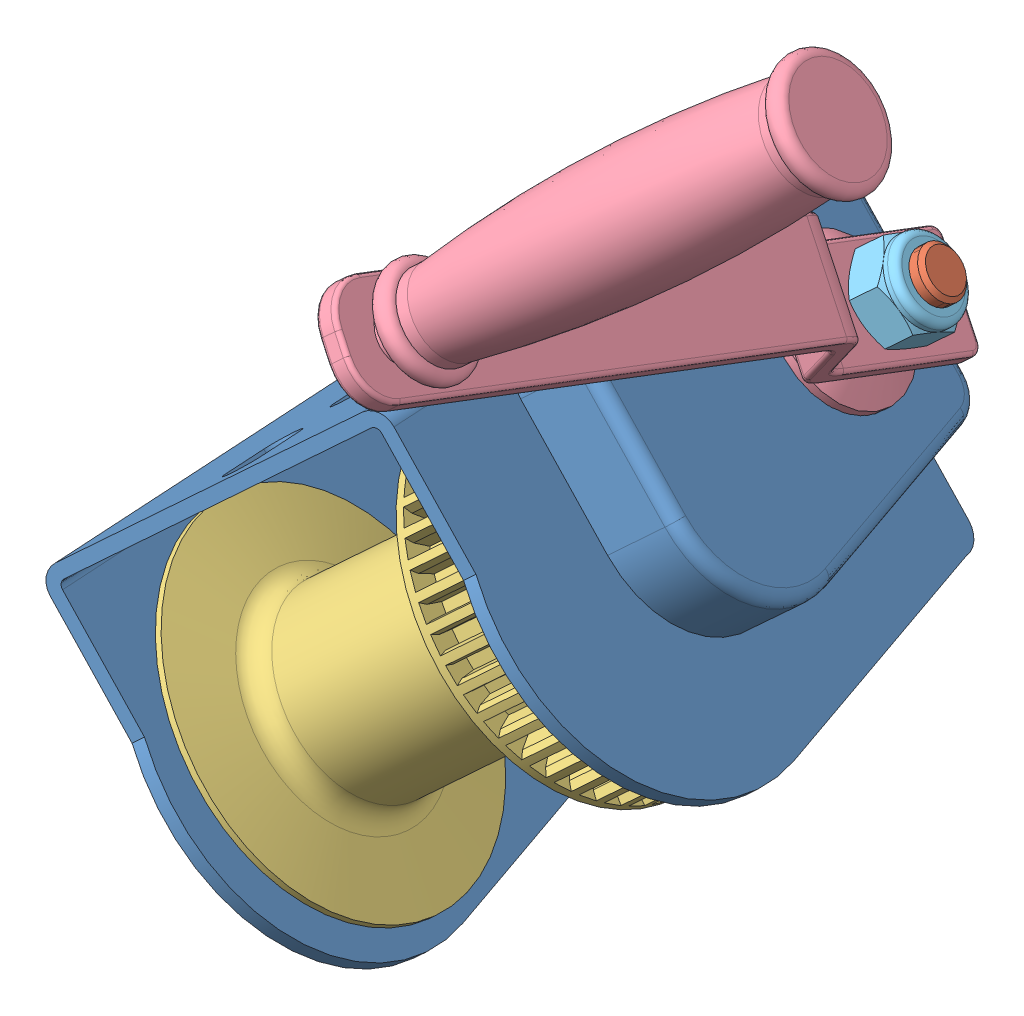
SolidWorks assembly TREUIL 4AF ASM.sldasm, configuration Défaut (file format 7000). Lengths in mm.
Overall size (224.6 291.55 223.87).
5 component instances, 5 part files, 9 mates.
Components (placement in the parent):
- BATI TREUIL 4AF-1: BATI TREUIL 4AF.SLDPRT [Défaut] at (91.5984 -188.4547 71.5388) x (0.720936 0.649082 -0.242783) z (-0.194803 -0.146398 -0.969855) size (108 94.91 127.55)
- AXE MANIVELLE TREUIL 4AF-1: AXE MANIVELLE TREUIL 4AF.SLDPRT [Défaut] at (31.1182 -153.7945 -28.7776) x (-0.531935 0.742855 0.406462) z (0.720936 0.649082 -0.242783) size (35.63 35.18 143)
- BOBINE TREUIL 4AF-1: BOBINE TREUIL 4AF.SLDPRT [Défaut] at (81.4205 -132.9408 13.6493) x (-0.720936 -0.649082 0.242783) z (0.021206 0.32951 0.943914) size (80.5 84 84)
- MANIVELLE TREUIL 4AF-1: MANIVELLE TREUIL 4AF.SLDPRT [Défaut] at (131.994 -2.2992 96.0574) x (0.692992 -0.673465 0.257305) z (0.720936 0.649082 -0.242783) size (35 190 153)
- ECROU NYLSTOP M12-1: ECROU NYLSTOP M12.SLDPRT [Défaut] at (122.4969 -71.5235 -59.5504) x (-0.615996 0.760716 0.204597) z (0.720936 0.649082 -0.242783) size (21.94 19 12)
Mates (geometry in assembly coordinates):
- Coïncidente1: coincident anti-aligned: plane of BATI TREUIL 4AF-1 through (109.8498 -92.3269 -53.8699) normal (0.720936 0.649082 -0.242783); plane of MANIVELLE TREUIL 4AF-1 through (103.2113 -79.1208 -38.276) normal (-0.720936 -0.649082 0.242783)
- Coaxiale2: concentric aligned: cylinder of BATI TREUIL 4AF-1 through (28.7751 -155.9041 -27.9886) axis (-0.720936 -0.649082 0.242783) radius 7; cylinder of AXE MANIVELLE TREUIL 4AF-1 through (31.1191 -153.7937 -28.7779) axis (-0.720936 -0.649082 0.242783) radius 6
- Coïncidente2: coincident anti-aligned: plane of BATI TREUIL 4AF-1 through (54.7338 -159.6471 25.7012) normal (0.720936 0.649082 -0.242783); plane of AXE MANIVELLE TREUIL 4AF-1 through (31.1182 -153.7945 -28.7776) normal (-0.720936 -0.649082 0.242783)
- Coaxiale3: concentric aligned: cylinder of ECROU NYLSTOP M12-1 through (116.0084 -77.3652 -57.3654) axis (-0.720936 -0.649082 0.242783) radius 5.3234; cylinder of AXE MANIVELLE TREUIL 4AF-1 through (31.1191 -153.7937 -28.7779) axis (-0.720936 -0.649082 0.242783) radius 6
- Coïncidente3: coincident anti-aligned: plane of MANIVELLE TREUIL 4AF-1 through (92.909 -61.2321 -82.8263) normal (0.720936 0.649082 -0.242783); plane of ECROU NYLSTOP M12-1 through (116.0084 -77.3652 -57.3654) normal (-0.720936 -0.649082 0.242783)
- Coïncidente4: coincident anti-aligned: plane of BATI TREUIL 4AF-1 through (54.7338 -159.6471 25.7012) normal (0.720936 0.649082 -0.242783); plane of BOBINE TREUIL 4AF-1 through (52.9435 -158.5796 23.2393) normal (-0.720936 -0.649082 0.242783)
- Coaxiale4: concentric aligned: cylinder of BATI TREUIL 4AF-1 through (52.9435 -158.5796 23.2393) axis (-0.720936 -0.649082 0.242783) radius 6; cylinder of BOBINE TREUIL 4AF-1 through (52.9435 -158.5796 23.2393) axis (-0.720936 -0.649082 0.242783) radius 6
- Coaxiale6: concentric anti-aligned: cylinder of AXE MANIVELLE TREUIL 4AF-1 through (31.1191 -153.7937 -28.7779) axis (-0.720936 -0.649082 0.242783) radius 6; cylinder of MANIVELLE TREUIL 4AF-1 through (116.0084 -77.3652 -57.3654) axis (0.720936 0.649082 -0.242783) radius 8
- Contr.Engrenages1: gear = 14 mm: cylinder of BOBINE TREUIL 4AF-1 through (110.9789 -106.3285 3.6952) axis (-0.720936 -0.649082 0.242783) radius 22; cone of AXE MANIVELLE TREUIL 4AF-1 through (81.6053 -108.3394 -45.7797) axis (-0.720936 -0.649082 0.242783)
